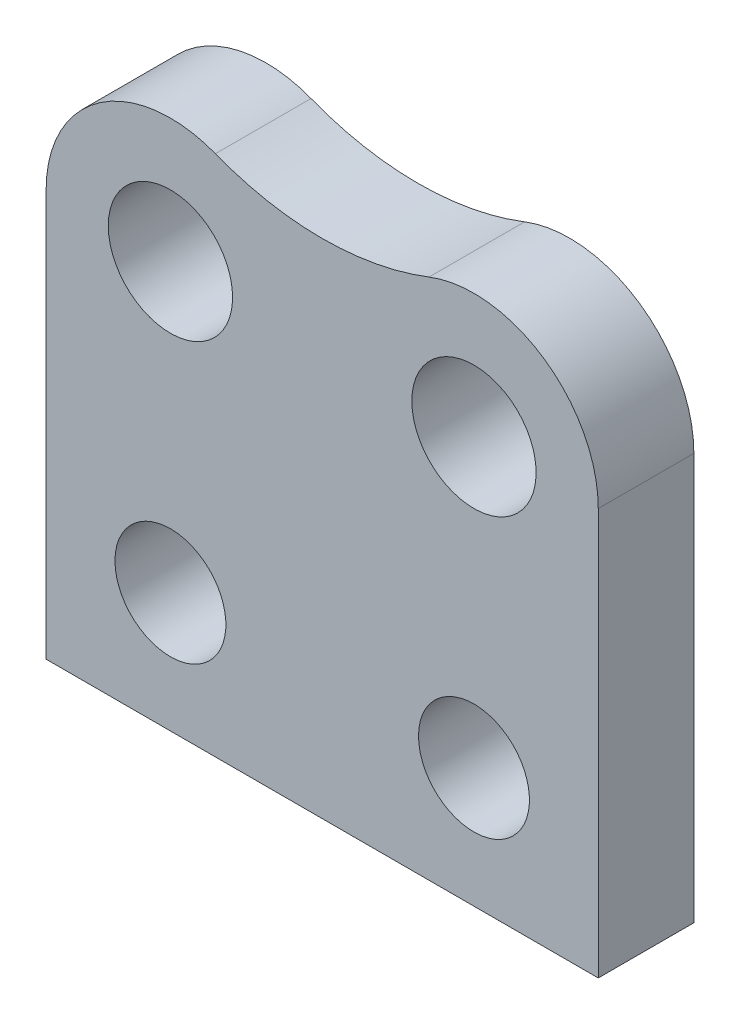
ISO-10303-21;
HEADER;
FILE_DESCRIPTION(('STEP AP214'),'2;1');
FILE_NAME('part.step','',(''),(''),'','','');
FILE_SCHEMA(('AUTOMOTIVE_DESIGN { 1 0 10303 214 1 1 1 1 }'));
ENDSEC;
DATA;
#1=APPLICATION_CONTEXT('core data for automotive mechanical design processes');
#2=APPLICATION_PROTOCOL_DEFINITION('international standard','automotive_design',2000,#1);
#3=PRODUCT_CONTEXT('',#1,'mechanical');
#4=PRODUCT('Part','Part','',(#3));
#5=PRODUCT_RELATED_PRODUCT_CATEGORY('part','',(#4));
#6=PRODUCT_DEFINITION_FORMATION('','',#4);
#7=PRODUCT_DEFINITION_CONTEXT('part definition',#1,'design');
#8=PRODUCT_DEFINITION('design','',#6,#7);
#9=PRODUCT_DEFINITION_SHAPE('','',#8);
#10=(LENGTH_UNIT() NAMED_UNIT(*) SI_UNIT(.MILLI.,.METRE.));
#11=(NAMED_UNIT(*) PLANE_ANGLE_UNIT() SI_UNIT($,.RADIAN.));
#12=(NAMED_UNIT(*) SI_UNIT($,.STERADIAN.) SOLID_ANGLE_UNIT());
#13=UNCERTAINTY_MEASURE_WITH_UNIT(LENGTH_MEASURE(1.E-05),#10,'distance_accuracy_value','');
#14=(GEOMETRIC_REPRESENTATION_CONTEXT(3) GLOBAL_UNCERTAINTY_ASSIGNED_CONTEXT((#13)) GLOBAL_UNIT_ASSIGNED_CONTEXT((#10,
#11,#12)) REPRESENTATION_CONTEXT('',''));
#15=CARTESIAN_POINT('',(0.,0.,0.));
#16=DIRECTION('',(0.,0.,1.));
#17=DIRECTION('',(1.,0.,0.));
#18=AXIS2_PLACEMENT_3D('',#15,#16,#17);
#19=CARTESIAN_POINT('',(0.,0.,0.));
#20=DIRECTION('',(0.,0.,-1.));
#21=DIRECTION('',(-1.,0.,0.));
#22=AXIS2_PLACEMENT_3D('',#19,#20,#21);
#23=PLANE('',#22);
#24=CARTESIAN_POINT('',(18.5131425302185,29.9594706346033,0.));
#25=DIRECTION('',(0.,0.,-1.));
#26=DIRECTION('',(-1.,0.,0.));
#27=AXIS2_PLACEMENT_3D('',#24,#25,#26);
#28=CIRCLE('',#27,1.3);
#29=CARTESIAN_POINT('',(17.2131425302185,29.9594706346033,0.));
#30=VERTEX_POINT('',#29);
#31=EDGE_CURVE('E167',#30,#30,#28,.T.);
#32=ORIENTED_EDGE('',*,*,#31,.T.);
#33=EDGE_LOOP('',(#32));
#34=FACE_BOUND('',#33,.T.);
#35=CARTESIAN_POINT('',(12.1631425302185,29.9594706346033,0.));
#36=DIRECTION('',(0.,0.,-1.));
#37=DIRECTION('',(-1.,0.,0.));
#38=AXIS2_PLACEMENT_3D('',#35,#36,#37);
#39=CIRCLE('',#38,1.3);
#40=CARTESIAN_POINT('',(10.8631425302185,29.9594706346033,0.));
#41=VERTEX_POINT('',#40);
#42=EDGE_CURVE('E158',#41,#41,#39,.T.);
#43=ORIENTED_EDGE('',*,*,#42,.T.);
#44=EDGE_LOOP('',(#43));
#45=FACE_BOUND('',#44,.T.);
#46=CARTESIAN_POINT('',(12.1631425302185,23.9594706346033,0.));
#47=DIRECTION('',(0.,0.,-1.));
#48=DIRECTION('',(-1.,0.,0.));
#49=AXIS2_PLACEMENT_3D('',#46,#47,#48);
#50=CIRCLE('',#49,1.16);
#51=CARTESIAN_POINT('',(11.0031425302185,23.9594706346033,0.));
#52=VERTEX_POINT('',#51);
#53=EDGE_CURVE('E139',#52,#52,#50,.T.);
#54=ORIENTED_EDGE('',*,*,#53,.T.);
#55=EDGE_LOOP('',(#54));
#56=FACE_BOUND('',#55,.T.);
#57=DIRECTION('',(0.,-1.,0.));
#58=VECTOR('',#57,1.);
#59=CARTESIAN_POINT('',(9.5631425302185,0.,0.));
#60=LINE('',#59,#58);
#61=CARTESIAN_POINT('',(9.5631425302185,29.9594706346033,0.));
#62=VERTEX_POINT('',#61);
#63=CARTESIAN_POINT('',(9.5631425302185,21.4547711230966,0.));
#64=VERTEX_POINT('',#63);
#65=EDGE_CURVE('E128',#62,#64,#60,.T.);
#66=ORIENTED_EDGE('',*,*,#65,.T.);
#67=DIRECTION('',(-1.,0.,0.));
#68=VECTOR('',#67,1.);
#69=CARTESIAN_POINT('',(0.,21.4547711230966,0.));
#70=LINE('',#69,#68);
#71=CARTESIAN_POINT('',(21.1131425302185,21.4547711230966,0.));
#72=VERTEX_POINT('',#71);
#73=EDGE_CURVE('E137',#72,#64,#70,.T.);
#74=ORIENTED_EDGE('',*,*,#73,.F.);
#75=DIRECTION('',(0.,-1.,0.));
#76=VECTOR('',#75,1.);
#77=CARTESIAN_POINT('',(21.1131425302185,0.,0.));
#78=LINE('',#77,#76);
#79=CARTESIAN_POINT('',(21.1131425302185,29.9594706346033,0.));
#80=VERTEX_POINT('',#79);
#81=EDGE_CURVE('E135',#80,#72,#78,.T.);
#82=ORIENTED_EDGE('',*,*,#81,.F.);
#83=CARTESIAN_POINT('',(18.5131425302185,29.9594706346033,0.));
#84=DIRECTION('',(0.,0.,-1.));
#85=DIRECTION('',(-1.,0.,0.));
#86=AXIS2_PLACEMENT_3D('',#83,#84,#85);
#87=CIRCLE('',#86,2.59999999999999);
#88=CARTESIAN_POINT('',(17.5718654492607,32.3831037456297,0.));
#89=VERTEX_POINT('',#88);
#90=EDGE_CURVE('E109',#89,#80,#87,.T.);
#91=ORIENTED_EDGE('',*,*,#90,.F.);
#92=CARTESIAN_POINT('',(15.3381425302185,38.1345715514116,0.));
#93=DIRECTION('',(0.,0.,-1.));
#94=DIRECTION('',(-1.,0.,0.));
#95=AXIS2_PLACEMENT_3D('',#92,#93,#94);
#96=CIRCLE('',#95,6.17000000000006);
#97=CARTESIAN_POINT('',(13.1044196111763,32.3831037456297,0.));
#98=VERTEX_POINT('',#97);
#99=EDGE_CURVE('E132',#89,#98,#96,.T.);
#100=ORIENTED_EDGE('',*,*,#99,.T.);
#101=CARTESIAN_POINT('',(12.1631425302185,29.9594706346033,0.));
#102=DIRECTION('',(0.,0.,-1.));
#103=DIRECTION('',(-1.,0.,0.));
#104=AXIS2_PLACEMENT_3D('',#101,#102,#103);
#105=CIRCLE('',#104,2.59999999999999);
#106=EDGE_CURVE('E77',#62,#98,#105,.T.);
#107=ORIENTED_EDGE('',*,*,#106,.F.);
#108=EDGE_LOOP('',(#66,#74,#82,#91,#100,#107));
#109=FACE_BOUND('',#108,.T.);
#110=CARTESIAN_POINT('',(18.5131425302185,23.9594706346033,0.));
#111=DIRECTION('',(0.,0.,-1.));
#112=DIRECTION('',(-1.,0.,0.));
#113=AXIS2_PLACEMENT_3D('',#110,#111,#112);
#114=CIRCLE('',#113,1.16);
#115=CARTESIAN_POINT('',(17.3531425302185,23.9594706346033,0.));
#116=VERTEX_POINT('',#115);
#117=EDGE_CURVE('E46',#116,#116,#114,.F.);
#118=ORIENTED_EDGE('',*,*,#117,.F.);
#119=EDGE_LOOP('',(#118));
#120=FACE_BOUND('',#119,.T.);
#121=ADVANCED_FACE('F42',(#34,#45,#56,#109,#120),#23,.F.);
#122=CARTESIAN_POINT('',(9.5631425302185,0.,-2.));
#123=DIRECTION('',(-1.,0.,0.));
#124=DIRECTION('',(0.,0.,1.));
#125=AXIS2_PLACEMENT_3D('',#122,#123,#124);
#126=PLANE('',#125);
#127=ORIENTED_EDGE('',*,*,#65,.F.);
#128=DIRECTION('',(0.,0.,1.));
#129=VECTOR('',#128,1.);
#130=CARTESIAN_POINT('',(9.5631425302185,29.9594706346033,-2.));
#131=LINE('',#130,#129);
#132=CARTESIAN_POINT('',(9.5631425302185,29.9594706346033,-2.));
#133=VERTEX_POINT('',#132);
#134=EDGE_CURVE('E11',#133,#62,#131,.T.);
#135=ORIENTED_EDGE('',*,*,#134,.F.);
#136=DIRECTION('',(0.,-1.,0.));
#137=VECTOR('',#136,1.);
#138=CARTESIAN_POINT('',(9.5631425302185,0.,-2.));
#139=LINE('',#138,#137);
#140=CARTESIAN_POINT('',(9.5631425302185,21.4547711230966,-2.));
#141=VERTEX_POINT('',#140);
#142=EDGE_CURVE('E142',#133,#141,#139,.T.);
#143=ORIENTED_EDGE('',*,*,#142,.T.);
#144=DIRECTION('',(0.,0.,1.));
#145=VECTOR('',#144,1.);
#146=CARTESIAN_POINT('',(9.5631425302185,21.4547711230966,-2.));
#147=LINE('',#146,#145);
#148=EDGE_CURVE('E127',#141,#64,#147,.T.);
#149=ORIENTED_EDGE('',*,*,#148,.T.);
#150=EDGE_LOOP('',(#127,#135,#143,#149));
#151=FACE_BOUND('',#150,.T.);
#152=ADVANCED_FACE('F44',(#151),#126,.T.);
#153=CARTESIAN_POINT('',(12.1631425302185,29.9594706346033,-2.));
#154=DIRECTION('',(0.,0.,1.));
#155=DIRECTION('',(1.,0.,0.));
#156=AXIS2_PLACEMENT_3D('',#153,#154,#155);
#157=CYLINDRICAL_SURFACE('',#156,2.59999999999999);
#158=ORIENTED_EDGE('',*,*,#106,.T.);
#159=DIRECTION('',(0.,0.,1.));
#160=VECTOR('',#159,1.);
#161=CARTESIAN_POINT('',(13.1044196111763,32.3831037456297,-2.));
#162=LINE('',#161,#160);
#163=CARTESIAN_POINT('',(13.1044196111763,32.3831037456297,-2.));
#164=VERTEX_POINT('',#163);
#165=EDGE_CURVE('E52',#164,#98,#162,.T.);
#166=ORIENTED_EDGE('',*,*,#165,.F.);
#167=CARTESIAN_POINT('',(12.1631425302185,29.9594706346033,-2.));
#168=DIRECTION('',(0.,0.,-1.));
#169=DIRECTION('',(-1.,0.,0.));
#170=AXIS2_PLACEMENT_3D('',#167,#168,#169);
#171=CIRCLE('',#170,2.59999999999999);
#172=EDGE_CURVE('E152',#133,#164,#171,.T.);
#173=ORIENTED_EDGE('',*,*,#172,.F.);
#174=ORIENTED_EDGE('',*,*,#134,.T.);
#175=EDGE_LOOP('',(#158,#166,#173,#174));
#176=FACE_BOUND('',#175,.T.);
#177=ADVANCED_FACE('F151',(#176),#157,.T.);
#178=CARTESIAN_POINT('',(15.3381425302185,38.1345715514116,-2.));
#179=DIRECTION('',(0.,0.,1.));
#180=DIRECTION('',(1.,0.,0.));
#181=AXIS2_PLACEMENT_3D('',#178,#179,#180);
#182=CYLINDRICAL_SURFACE('',#181,6.17000000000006);
#183=ORIENTED_EDGE('',*,*,#99,.F.);
#184=DIRECTION('',(0.,0.,1.));
#185=VECTOR('',#184,1.);
#186=CARTESIAN_POINT('',(17.5718654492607,32.3831037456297,-2.));
#187=LINE('',#186,#185);
#188=CARTESIAN_POINT('',(17.5718654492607,32.3831037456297,-2.));
#189=VERTEX_POINT('',#188);
#190=EDGE_CURVE('E112',#189,#89,#187,.T.);
#191=ORIENTED_EDGE('',*,*,#190,.F.);
#192=CARTESIAN_POINT('',(15.3381425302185,38.1345715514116,-2.));
#193=DIRECTION('',(0.,0.,-1.));
#194=DIRECTION('',(-1.,0.,0.));
#195=AXIS2_PLACEMENT_3D('',#192,#193,#194);
#196=CIRCLE('',#195,6.17000000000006);
#197=EDGE_CURVE('E101',#189,#164,#196,.T.);
#198=ORIENTED_EDGE('',*,*,#197,.T.);
#199=ORIENTED_EDGE('',*,*,#165,.T.);
#200=EDGE_LOOP('',(#183,#191,#198,#199));
#201=FACE_BOUND('',#200,.T.);
#202=ADVANCED_FACE('F150',(#201),#182,.F.);
#203=CARTESIAN_POINT('',(18.5131425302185,29.9594706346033,-2.));
#204=DIRECTION('',(0.,0.,1.));
#205=DIRECTION('',(1.,0.,0.));
#206=AXIS2_PLACEMENT_3D('',#203,#204,#205);
#207=CYLINDRICAL_SURFACE('',#206,2.59999999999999);
#208=ORIENTED_EDGE('',*,*,#90,.T.);
#209=DIRECTION('',(0.,0.,1.));
#210=VECTOR('',#209,1.);
#211=CARTESIAN_POINT('',(21.1131425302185,29.9594706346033,-2.));
#212=LINE('',#211,#210);
#213=CARTESIAN_POINT('',(21.1131425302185,29.9594706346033,-2.));
#214=VERTEX_POINT('',#213);
#215=EDGE_CURVE('E107',#214,#80,#212,.T.);
#216=ORIENTED_EDGE('',*,*,#215,.F.);
#217=CARTESIAN_POINT('',(18.5131425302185,29.9594706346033,-2.));
#218=DIRECTION('',(0.,0.,-1.));
#219=DIRECTION('',(-1.,0.,0.));
#220=AXIS2_PLACEMENT_3D('',#217,#218,#219);
#221=CIRCLE('',#220,2.59999999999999);
#222=EDGE_CURVE('E93',#189,#214,#221,.T.);
#223=ORIENTED_EDGE('',*,*,#222,.F.);
#224=ORIENTED_EDGE('',*,*,#190,.T.);
#225=EDGE_LOOP('',(#208,#216,#223,#224));
#226=FACE_BOUND('',#225,.T.);
#227=ADVANCED_FACE('F108',(#226),#207,.T.);
#228=CARTESIAN_POINT('',(21.1131425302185,0.,-2.));
#229=DIRECTION('',(-1.,0.,0.));
#230=DIRECTION('',(0.,0.,1.));
#231=AXIS2_PLACEMENT_3D('',#228,#229,#230);
#232=PLANE('',#231);
#233=ORIENTED_EDGE('',*,*,#81,.T.);
#234=DIRECTION('',(0.,0.,1.));
#235=VECTOR('',#234,1.);
#236=CARTESIAN_POINT('',(21.1131425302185,21.4547711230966,-2.));
#237=LINE('',#236,#235);
#238=CARTESIAN_POINT('',(21.1131425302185,21.4547711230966,-2.));
#239=VERTEX_POINT('',#238);
#240=EDGE_CURVE('E113',#239,#72,#237,.T.);
#241=ORIENTED_EDGE('',*,*,#240,.F.);
#242=DIRECTION('',(0.,-1.,0.));
#243=VECTOR('',#242,1.);
#244=CARTESIAN_POINT('',(21.1131425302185,0.,-2.));
#245=LINE('',#244,#243);
#246=EDGE_CURVE('E98',#214,#239,#245,.T.);
#247=ORIENTED_EDGE('',*,*,#246,.F.);
#248=ORIENTED_EDGE('',*,*,#215,.T.);
#249=EDGE_LOOP('',(#233,#241,#247,#248));
#250=FACE_BOUND('',#249,.T.);
#251=ADVANCED_FACE('F115',(#250),#232,.F.);
#252=CARTESIAN_POINT('',(12.1631425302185,23.9594706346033,-2.));
#253=DIRECTION('',(0.,0.,1.));
#254=DIRECTION('',(1.,0.,0.));
#255=AXIS2_PLACEMENT_3D('',#252,#253,#254);
#256=CYLINDRICAL_SURFACE('',#255,1.16);
#257=CARTESIAN_POINT('',(12.1631425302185,23.9594706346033,-2.));
#258=DIRECTION('',(0.,0.,-1.));
#259=DIRECTION('',(-1.,0.,0.));
#260=AXIS2_PLACEMENT_3D('',#257,#258,#259);
#261=CIRCLE('',#260,1.16);
#262=CARTESIAN_POINT('',(11.0031425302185,23.9594706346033,-2.));
#263=VERTEX_POINT('',#262);
#264=EDGE_CURVE('E118',#263,#263,#261,.T.);
#265=ORIENTED_EDGE('',*,*,#264,.T.);
#266=EDGE_LOOP('',(#265));
#267=FACE_BOUND('',#266,.T.);
#268=ORIENTED_EDGE('',*,*,#53,.F.);
#269=EDGE_LOOP('',(#268));
#270=FACE_BOUND('',#269,.T.);
#271=ADVANCED_FACE('F191',(#267,#270),#256,.F.);
#272=CARTESIAN_POINT('',(0.,21.4547711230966,-2.));
#273=DIRECTION('',(0.,1.,0.));
#274=DIRECTION('',(0.,0.,1.));
#275=AXIS2_PLACEMENT_3D('',#272,#273,#274);
#276=PLANE('',#275);
#277=ORIENTED_EDGE('',*,*,#73,.T.);
#278=ORIENTED_EDGE('',*,*,#148,.F.);
#279=DIRECTION('',(-1.,0.,0.));
#280=VECTOR('',#279,1.);
#281=CARTESIAN_POINT('',(0.,21.4547711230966,-2.));
#282=LINE('',#281,#280);
#283=EDGE_CURVE('E60',#239,#141,#282,.T.);
#284=ORIENTED_EDGE('',*,*,#283,.F.);
#285=ORIENTED_EDGE('',*,*,#240,.T.);
#286=EDGE_LOOP('',(#277,#278,#284,#285));
#287=FACE_BOUND('',#286,.T.);
#288=ADVANCED_FACE('F189',(#287),#276,.F.);
#289=CARTESIAN_POINT('',(18.5131425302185,23.9594706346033,-2.));
#290=DIRECTION('',(0.,0.,1.));
#291=DIRECTION('',(1.,0.,0.));
#292=AXIS2_PLACEMENT_3D('',#289,#290,#291);
#293=CYLINDRICAL_SURFACE('',#292,1.16);
#294=CARTESIAN_POINT('',(18.5131425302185,23.9594706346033,-2.));
#295=DIRECTION('',(0.,0.,-1.));
#296=DIRECTION('',(-1.,0.,0.));
#297=AXIS2_PLACEMENT_3D('',#294,#295,#296);
#298=CIRCLE('',#297,1.16);
#299=CARTESIAN_POINT('',(17.3531425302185,23.9594706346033,-2.));
#300=VERTEX_POINT('',#299);
#301=EDGE_CURVE('E124',#300,#300,#298,.T.);
#302=ORIENTED_EDGE('',*,*,#301,.T.);
#303=EDGE_LOOP('',(#302));
#304=FACE_BOUND('',#303,.T.);
#305=ORIENTED_EDGE('',*,*,#117,.T.);
#306=EDGE_LOOP('',(#305));
#307=FACE_BOUND('',#306,.T.);
#308=ADVANCED_FACE('F174',(#304,#307),#293,.F.);
#309=CARTESIAN_POINT('',(0.,0.,-2.));
#310=DIRECTION('',(0.,0.,-1.));
#311=DIRECTION('',(-1.,0.,0.));
#312=AXIS2_PLACEMENT_3D('',#309,#310,#311);
#313=PLANE('',#312);
#314=CARTESIAN_POINT('',(18.5131425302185,29.9594706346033,-2.));
#315=DIRECTION('',(0.,0.,-1.));
#316=DIRECTION('',(-1.,0.,0.));
#317=AXIS2_PLACEMENT_3D('',#314,#315,#316);
#318=CIRCLE('',#317,1.3);
#319=CARTESIAN_POINT('',(17.2131425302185,29.9594706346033,-2.));
#320=VERTEX_POINT('',#319);
#321=EDGE_CURVE('E164',#320,#320,#318,.T.);
#322=ORIENTED_EDGE('',*,*,#321,.F.);
#323=EDGE_LOOP('',(#322));
#324=FACE_BOUND('',#323,.T.);
#325=CARTESIAN_POINT('',(12.1631425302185,29.9594706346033,-2.));
#326=DIRECTION('',(0.,0.,-1.));
#327=DIRECTION('',(-1.,0.,0.));
#328=AXIS2_PLACEMENT_3D('',#325,#326,#327);
#329=CIRCLE('',#328,1.3);
#330=CARTESIAN_POINT('',(10.8631425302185,29.9594706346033,-2.));
#331=VERTEX_POINT('',#330);
#332=EDGE_CURVE('E161',#331,#331,#329,.T.);
#333=ORIENTED_EDGE('',*,*,#332,.F.);
#334=EDGE_LOOP('',(#333));
#335=FACE_BOUND('',#334,.T.);
#336=ORIENTED_EDGE('',*,*,#142,.F.);
#337=ORIENTED_EDGE('',*,*,#172,.T.);
#338=ORIENTED_EDGE('',*,*,#197,.F.);
#339=ORIENTED_EDGE('',*,*,#222,.T.);
#340=ORIENTED_EDGE('',*,*,#246,.T.);
#341=ORIENTED_EDGE('',*,*,#283,.T.);
#342=EDGE_LOOP('',(#336,#337,#338,#339,#340,#341));
#343=FACE_BOUND('',#342,.T.);
#344=ORIENTED_EDGE('',*,*,#264,.F.);
#345=EDGE_LOOP('',(#344));
#346=FACE_BOUND('',#345,.T.);
#347=ORIENTED_EDGE('',*,*,#301,.F.);
#348=EDGE_LOOP('',(#347));
#349=FACE_BOUND('',#348,.T.);
#350=ADVANCED_FACE('F95',(#324,#335,#343,#346,#349),#313,.T.);
#351=CARTESIAN_POINT('',(12.1631425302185,29.9594706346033,0.));
#352=DIRECTION('',(0.,0.,-1.));
#353=DIRECTION('',(-1.,0.,0.));
#354=AXIS2_PLACEMENT_3D('',#351,#352,#353);
#355=CYLINDRICAL_SURFACE('',#354,1.3);
#356=ORIENTED_EDGE('',*,*,#42,.F.);
#357=EDGE_LOOP('',(#356));
#358=FACE_BOUND('',#357,.T.);
#359=ORIENTED_EDGE('',*,*,#332,.T.);
#360=EDGE_LOOP('',(#359));
#361=FACE_BOUND('',#360,.T.);
#362=ADVANCED_FACE('F237',(#358,#361),#355,.F.);
#363=CARTESIAN_POINT('',(18.5131425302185,29.9594706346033,0.));
#364=DIRECTION('',(0.,0.,-1.));
#365=DIRECTION('',(-1.,0.,0.));
#366=AXIS2_PLACEMENT_3D('',#363,#364,#365);
#367=CYLINDRICAL_SURFACE('',#366,1.3);
#368=ORIENTED_EDGE('',*,*,#31,.F.);
#369=EDGE_LOOP('',(#368));
#370=FACE_BOUND('',#369,.T.);
#371=ORIENTED_EDGE('',*,*,#321,.T.);
#372=EDGE_LOOP('',(#371));
#373=FACE_BOUND('',#372,.T.);
#374=ADVANCED_FACE('F246',(#370,#373),#367,.F.);
#375=CLOSED_SHELL('',(#121,#152,#177,#202,#227,#251,#271,#288,#308,#350,#362,#374));
#376=MANIFOLD_SOLID_BREP('B2',#375);
#377=ADVANCED_BREP_SHAPE_REPRESENTATION('',(#18,#376),#14);
#378=SHAPE_DEFINITION_REPRESENTATION(#9,#377);
ENDSEC;
END-ISO-10303-21;
